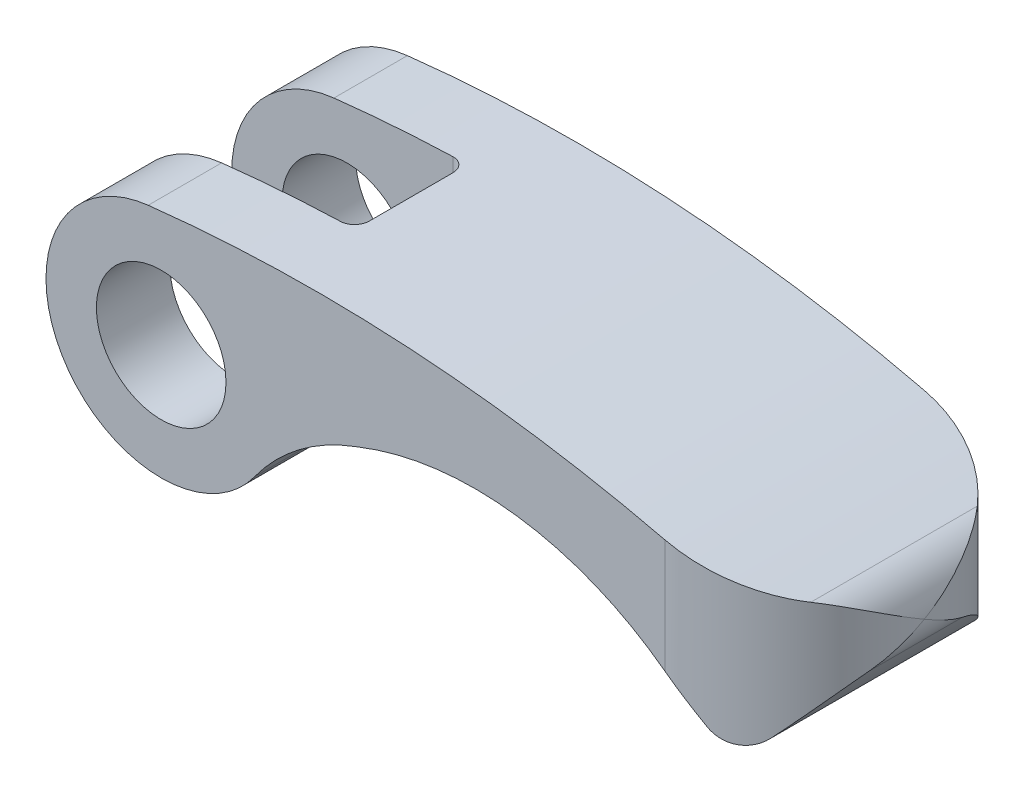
ISO-10303-21;
HEADER;
FILE_DESCRIPTION(('STEP AP214'),'2;1');
FILE_NAME('part.step','',(''),(''),'','','');
FILE_SCHEMA(('AUTOMOTIVE_DESIGN { 1 0 10303 214 1 1 1 1 }'));
ENDSEC;
DATA;
#1=APPLICATION_CONTEXT('core data for automotive mechanical design processes');
#2=APPLICATION_PROTOCOL_DEFINITION('international standard','automotive_design',2000,#1);
#3=PRODUCT_CONTEXT('',#1,'mechanical');
#4=PRODUCT('Part','Part','',(#3));
#5=PRODUCT_RELATED_PRODUCT_CATEGORY('part','',(#4));
#6=PRODUCT_DEFINITION_FORMATION('','',#4);
#7=PRODUCT_DEFINITION_CONTEXT('part definition',#1,'design');
#8=PRODUCT_DEFINITION('design','',#6,#7);
#9=PRODUCT_DEFINITION_SHAPE('','',#8);
#10=(LENGTH_UNIT() NAMED_UNIT(*) SI_UNIT(.MILLI.,.METRE.));
#11=(NAMED_UNIT(*) PLANE_ANGLE_UNIT() SI_UNIT($,.RADIAN.));
#12=(NAMED_UNIT(*) SI_UNIT($,.STERADIAN.) SOLID_ANGLE_UNIT());
#13=UNCERTAINTY_MEASURE_WITH_UNIT(LENGTH_MEASURE(1.E-05),#10,'distance_accuracy_value','');
#14=(GEOMETRIC_REPRESENTATION_CONTEXT(3) GLOBAL_UNCERTAINTY_ASSIGNED_CONTEXT((#13)) GLOBAL_UNIT_ASSIGNED_CONTEXT((#10,
#11,#12)) REPRESENTATION_CONTEXT('',''));
#15=CARTESIAN_POINT('',(0.,0.,0.));
#16=DIRECTION('',(0.,0.,1.));
#17=DIRECTION('',(1.,0.,0.));
#18=AXIS2_PLACEMENT_3D('',#15,#16,#17);
#19=CARTESIAN_POINT('',(0.,0.,9.));
#20=DIRECTION('',(0.,0.,-1.));
#21=DIRECTION('',(-1.,0.,0.));
#22=AXIS2_PLACEMENT_3D('',#19,#20,#21);
#23=CYLINDRICAL_SURFACE('',#22,8.);
#24=DIRECTION('',(0.,0.,-1.));
#25=VECTOR('',#24,1.);
#26=CARTESIAN_POINT('',(-0.90221048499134,7.94896321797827,9.));
#27=LINE('',#26,#25);
#28=CARTESIAN_POINT('',(-0.90221048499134,7.94896321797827,9.));
#29=VERTEX_POINT('',#28);
#30=CARTESIAN_POINT('',(-0.90221048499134,7.94896321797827,3.9));
#31=VERTEX_POINT('',#30);
#32=EDGE_CURVE('E155',#29,#31,#27,.T.);
#33=ORIENTED_EDGE('',*,*,#32,.T.);
#34=CARTESIAN_POINT('',(0.,0.,3.9));
#35=DIRECTION('',(0.,0.,1.));
#36=DIRECTION('',(1.,0.,0.));
#37=AXIS2_PLACEMENT_3D('',#34,#35,#36);
#38=CIRCLE('',#37,8.);
#39=CARTESIAN_POINT('',(6.48844630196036,-4.67975048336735,3.9));
#40=VERTEX_POINT('',#39);
#41=EDGE_CURVE('E250',#31,#40,#38,.T.);
#42=ORIENTED_EDGE('',*,*,#41,.T.);
#43=DIRECTION('',(0.,0.,-1.));
#44=VECTOR('',#43,1.);
#45=CARTESIAN_POINT('',(6.48844630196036,-4.67975048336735,9.));
#46=LINE('',#45,#44);
#47=CARTESIAN_POINT('',(6.48844630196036,-4.67975048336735,9.));
#48=VERTEX_POINT('',#47);
#49=EDGE_CURVE('E200',#48,#40,#46,.T.);
#50=ORIENTED_EDGE('',*,*,#49,.F.);
#51=CARTESIAN_POINT('',(0.,0.,9.));
#52=DIRECTION('',(0.,0.,1.));
#53=DIRECTION('',(1.,0.,0.));
#54=AXIS2_PLACEMENT_3D('',#51,#52,#53);
#55=CIRCLE('',#54,8.);
#56=EDGE_CURVE('E156',#29,#48,#55,.T.);
#57=ORIENTED_EDGE('',*,*,#56,.F.);
#58=EDGE_LOOP('',(#33,#42,#50,#57));
#59=FACE_BOUND('',#58,.T.);
#60=ADVANCED_FACE('F14',(#59),#23,.T.);
#61=CARTESIAN_POINT('',(41.,1.,9.));
#62=DIRECTION('',(0.,0.,-1.));
#63=DIRECTION('',(-1.,0.,0.));
#64=AXIS2_PLACEMENT_3D('',#61,#62,#63);
#65=CYLINDRICAL_SURFACE('',#64,3.);
#66=DIRECTION('',(0.,0.,-1.));
#67=VECTOR('',#66,1.);
#68=CARTESIAN_POINT('',(41.8962414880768,3.8629968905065,9.));
#69=LINE('',#68,#67);
#70=CARTESIAN_POINT('',(41.8962414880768,3.86299689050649,5.7828931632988));
#71=VERTEX_POINT('',#70);
#72=CARTESIAN_POINT('',(41.8962414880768,3.86299689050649,-5.7828931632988));
#73=VERTEX_POINT('',#72);
#74=EDGE_CURVE('E172',#71,#73,#69,.T.);
#75=ORIENTED_EDGE('',*,*,#74,.F.);
#76=CARTESIAN_POINT('',(41.8962414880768,3.86299689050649,5.7828931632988));
#77=CARTESIAN_POINT('',(41.9585607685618,3.84348410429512,5.70857649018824));
#78=CARTESIAN_POINT('',(42.0194338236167,3.82219864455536,5.63354317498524));
#79=CARTESIAN_POINT('',(42.1382624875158,3.77640355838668,5.48219499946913));
#80=CARTESIAN_POINT('',(42.1962189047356,3.75189483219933,5.40588050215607));
#81=CARTESIAN_POINT('',(42.3655158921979,3.6740941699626,5.17546673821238));
#82=CARTESIAN_POINT('',(42.4725165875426,3.61645262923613,5.01961913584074));
#83=CARTESIAN_POINT('',(42.6744475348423,3.49203218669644,4.70506484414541));
#84=CARTESIAN_POINT('',(42.7694334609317,3.42529864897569,4.54637554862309));
#85=CARTESIAN_POINT('',(42.948227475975,3.28415961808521,4.22603202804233));
#86=CARTESIAN_POINT('',(43.032028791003,3.20974952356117,4.06437607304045));
#87=CARTESIAN_POINT('',(43.2252706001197,3.01849618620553,3.66267678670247));
#88=CARTESIAN_POINT('',(43.3284019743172,2.89806801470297,3.42129086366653));
#89=CARTESIAN_POINT('',(43.5119649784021,2.64747112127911,2.9349691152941));
#90=CARTESIAN_POINT('',(43.5923887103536,2.51729903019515,2.69003208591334));
#91=CARTESIAN_POINT('',(43.7314028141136,2.2498735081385,2.19732378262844));
#92=CARTESIAN_POINT('',(43.7899568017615,2.11260870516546,1.94954848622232));
#93=CARTESIAN_POINT('',(43.8856163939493,1.83363611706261,1.45252620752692));
#94=CARTESIAN_POINT('',(43.9227320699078,1.69193045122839,1.20327997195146));
#95=CARTESIAN_POINT('',(43.9659639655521,1.45968964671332,0.797572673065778));
#96=CARTESIAN_POINT('',(43.9784847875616,1.36987899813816,0.64134363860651));
#97=CARTESIAN_POINT('',(43.9953480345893,1.18987221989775,0.328879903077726));
#98=CARTESIAN_POINT('',(43.9996998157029,1.09967664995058,0.172645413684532));
#99=CARTESIAN_POINT('',(43.9999949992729,1.00632454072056,0.0109544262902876));
#100=CARTESIAN_POINT('',(43.9999999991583,1.00316226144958,0.00547719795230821));
#101=CARTESIAN_POINT('',(44.,1.,0.));
#102=B_SPLINE_CURVE_WITH_KNOTS('',3,(#76,#77,#78,#79,#80,#81,#82,#83,#84,#85,#86,#87,#88,#89,
#90,#91,#92,#93,#94,#95,#96,#97,#98,#99,#100,#101),.UNSPECIFIED.,.F.,.F.,(4,2,2,2,2,2,2,2,2,2,2,
2,4),(0.,0.296726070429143,0.593369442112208,1.18554987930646,1.77487705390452,2.36455954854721,
3.22969626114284,4.09513350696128,4.9620042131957,5.82846734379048,6.37022582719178,
6.91136344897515,6.93033712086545),.UNSPECIFIED.);
#103=CARTESIAN_POINT('',(44.,1.,0.));
#104=VERTEX_POINT('',#103);
#105=EDGE_CURVE('E136',#71,#104,#102,.T.);
#106=ORIENTED_EDGE('',*,*,#105,.T.);
#107=CARTESIAN_POINT('',(41.8962414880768,3.86299689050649,-5.7828931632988));
#108=CARTESIAN_POINT('',(41.9585607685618,3.84348410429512,-5.70857649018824));
#109=CARTESIAN_POINT('',(42.0194338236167,3.82219864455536,-5.63354317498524));
#110=CARTESIAN_POINT('',(42.1382624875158,3.77640355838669,-5.48219499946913));
#111=CARTESIAN_POINT('',(42.1962189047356,3.75189483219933,-5.40588050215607));
#112=CARTESIAN_POINT('',(42.3655158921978,3.6740941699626,-5.17546673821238));
#113=CARTESIAN_POINT('',(42.4725165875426,3.61645262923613,-5.01961913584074));
#114=CARTESIAN_POINT('',(42.6744475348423,3.49203218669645,-4.70506484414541));
#115=CARTESIAN_POINT('',(42.7694334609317,3.42529864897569,-4.54637554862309));
#116=CARTESIAN_POINT('',(42.948227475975,3.28415961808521,-4.22603202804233));
#117=CARTESIAN_POINT('',(43.032028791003,3.20974952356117,-4.06437607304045));
#118=CARTESIAN_POINT('',(43.2252706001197,3.01849618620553,-3.66267678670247));
#119=CARTESIAN_POINT('',(43.3284019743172,2.89806801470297,-3.42129086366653));
#120=CARTESIAN_POINT('',(43.5119649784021,2.64747112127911,-2.9349691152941));
#121=CARTESIAN_POINT('',(43.5923887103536,2.51729903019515,-2.69003208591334));
#122=CARTESIAN_POINT('',(43.7314028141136,2.2498735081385,-2.19732378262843));
#123=CARTESIAN_POINT('',(43.7899568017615,2.11260870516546,-1.94954848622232));
#124=CARTESIAN_POINT('',(43.8856163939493,1.83363611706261,-1.45252620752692));
#125=CARTESIAN_POINT('',(43.9227320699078,1.69193045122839,-1.20327997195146));
#126=CARTESIAN_POINT('',(43.9659639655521,1.45968964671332,-0.797572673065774));
#127=CARTESIAN_POINT('',(43.9784847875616,1.36987899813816,-0.641343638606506));
#128=CARTESIAN_POINT('',(43.9953480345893,1.18987221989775,-0.328879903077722));
#129=CARTESIAN_POINT('',(43.9996998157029,1.09967664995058,-0.172645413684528));
#130=CARTESIAN_POINT('',(43.9999949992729,1.00632454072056,-0.0109544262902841));
#131=CARTESIAN_POINT('',(43.9999999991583,1.00316226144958,-0.00547719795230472));
#132=CARTESIAN_POINT('',(44.,1.,0.));
#133=B_SPLINE_CURVE_WITH_KNOTS('',3,(#107,#108,#109,#110,#111,#112,#113,#114,#115,#116,#117,
#118,#119,#120,#121,#122,#123,#124,#125,#126,#127,#128,#129,#130,#131,#132),.UNSPECIFIED.,.F.,
.F.,(4,2,2,2,2,2,2,2,2,2,2,2,4),(0.,0.296726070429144,0.59336944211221,1.18554987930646,
1.77487705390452,2.36455954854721,3.22969626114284,4.09513350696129,4.9620042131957,
5.82846734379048,6.37022582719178,6.91136344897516,6.93033712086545),.UNSPECIFIED.);
#134=EDGE_CURVE('E285',#104,#73,#133,.F.);
#135=ORIENTED_EDGE('',*,*,#134,.T.);
#136=EDGE_LOOP('',(#75,#106,#135));
#137=FACE_BOUND('',#136,.T.);
#138=ADVANCED_FACE('F309',(#137),#65,.T.);
#139=CARTESIAN_POINT('',(5.41326290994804,-47.6937793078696,9.));
#140=DIRECTION('',(0.,0.,1.));
#141=DIRECTION('',(1.,0.,0.));
#142=AXIS2_PLACEMENT_3D('',#139,#140,#141);
#143=PLANE('',#142);
#144=CARTESIAN_POINT('',(0.,0.,9.));
#145=DIRECTION('',(0.,0.,1.));
#146=DIRECTION('',(1.,0.,0.));
#147=AXIS2_PLACEMENT_3D('',#144,#145,#146);
#148=CIRCLE('',#147,4.5);
#149=CARTESIAN_POINT('',(4.5,0.,9.));
#150=VERTEX_POINT('',#149);
#151=EDGE_CURVE('E284',#150,#150,#148,.F.);
#152=ORIENTED_EDGE('',*,*,#151,.T.);
#153=EDGE_LOOP('',(#152));
#154=FACE_BOUND('',#153,.T.);
#155=CARTESIAN_POINT('',(21.8048695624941,-19.7429832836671,9.));
#156=DIRECTION('',(0.,0.,1.));
#157=DIRECTION('',(1.,0.,0.));
#158=AXIS2_PLACEMENT_3D('',#155,#156,#157);
#159=CIRCLE('',#158,22.);
#160=CARTESIAN_POINT('',(35.,-2.13933216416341,9.));
#161=VERTEX_POINT('',#160);
#162=CARTESIAN_POINT('',(13.6890217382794,0.705317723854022,9.));
#163=VERTEX_POINT('',#162);
#164=EDGE_CURVE('E148',#161,#163,#159,.T.);
#165=ORIENTED_EDGE('',*,*,#164,.F.);
#166=DIRECTION('',(0.,-1.,0.));
#167=VECTOR('',#166,1.);
#168=CARTESIAN_POINT('',(35.,11.,9.));
#169=LINE('',#168,#167);
#170=CARTESIAN_POINT('',(35.,5.7640263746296,9.));
#171=VERTEX_POINT('',#170);
#172=EDGE_CURVE('E133',#171,#161,#169,.T.);
#173=ORIENTED_EDGE('',*,*,#172,.F.);
#174=CARTESIAN_POINT('',(10.8265258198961,-95.3875586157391,9.));
#175=DIRECTION('',(0.,0.,1.));
#176=DIRECTION('',(1.,0.,0.));
#177=AXIS2_PLACEMENT_3D('',#174,#175,#176);
#178=CIRCLE('',#177,104.);
#179=EDGE_CURVE('E145',#171,#29,#178,.T.);
#180=ORIENTED_EDGE('',*,*,#179,.T.);
#181=ORIENTED_EDGE('',*,*,#56,.T.);
#182=CARTESIAN_POINT('',(18.6542829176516,-13.4542829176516,9.));
#183=DIRECTION('',(0.,0.,1.));
#184=DIRECTION('',(1.,0.,0.));
#185=AXIS2_PLACEMENT_3D('',#182,#183,#184);
#186=CIRCLE('',#185,15.);
#187=CARTESIAN_POINT('',(13.4617133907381,0.618286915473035,9.));
#188=VERTEX_POINT('',#187);
#189=EDGE_CURVE('E159',#188,#48,#186,.T.);
#190=ORIENTED_EDGE('',*,*,#189,.F.);
#191=CARTESIAN_POINT('',(10.000000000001,9.99999999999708,9.));
#192=DIRECTION('',(0.,0.,1.));
#193=DIRECTION('',(1.,0.,0.));
#194=AXIS2_PLACEMENT_3D('',#191,#192,#193);
#195=CIRCLE('',#194,9.99999999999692);
#196=EDGE_CURVE('E169',#188,#163,#195,.T.);
#197=ORIENTED_EDGE('',*,*,#196,.T.);
#198=EDGE_LOOP('',(#165,#173,#180,#181,#190,#197));
#199=FACE_BOUND('',#198,.T.);
#200=ADVANCED_FACE('F144',(#154,#199),#143,.T.);
#201=CARTESIAN_POINT('',(5.41326290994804,-47.6937793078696,-9.));
#202=DIRECTION('',(0.,0.,1.));
#203=DIRECTION('',(1.,0.,0.));
#204=AXIS2_PLACEMENT_3D('',#201,#202,#203);
#205=PLANE('',#204);
#206=CARTESIAN_POINT('',(0.,0.,-9.));
#207=DIRECTION('',(0.,0.,1.));
#208=DIRECTION('',(1.,0.,0.));
#209=AXIS2_PLACEMENT_3D('',#206,#207,#208);
#210=CIRCLE('',#209,4.5);
#211=CARTESIAN_POINT('',(4.5,0.,-9.));
#212=VERTEX_POINT('',#211);
#213=EDGE_CURVE('E434',#212,#212,#210,.F.);
#214=ORIENTED_EDGE('',*,*,#213,.F.);
#215=EDGE_LOOP('',(#214));
#216=FACE_BOUND('',#215,.T.);
#217=DIRECTION('',(0.,-1.,0.));
#218=VECTOR('',#217,1.);
#219=CARTESIAN_POINT('',(35.,11.,-9.));
#220=LINE('',#219,#218);
#221=CARTESIAN_POINT('',(35.,5.7640263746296,-9.));
#222=VERTEX_POINT('',#221);
#223=CARTESIAN_POINT('',(35.,-2.13933216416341,-9.));
#224=VERTEX_POINT('',#223);
#225=EDGE_CURVE('E149',#222,#224,#220,.T.);
#226=ORIENTED_EDGE('',*,*,#225,.T.);
#227=CARTESIAN_POINT('',(21.8048695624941,-19.7429832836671,-9.));
#228=DIRECTION('',(0.,0.,1.));
#229=DIRECTION('',(1.,0.,0.));
#230=AXIS2_PLACEMENT_3D('',#227,#228,#229);
#231=CIRCLE('',#230,22.);
#232=CARTESIAN_POINT('',(13.6890217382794,0.705317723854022,-9.));
#233=VERTEX_POINT('',#232);
#234=EDGE_CURVE('E157',#224,#233,#231,.T.);
#235=ORIENTED_EDGE('',*,*,#234,.T.);
#236=CARTESIAN_POINT('',(10.000000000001,9.99999999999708,-9.));
#237=DIRECTION('',(0.,0.,1.));
#238=DIRECTION('',(1.,0.,0.));
#239=AXIS2_PLACEMENT_3D('',#236,#237,#238);
#240=CIRCLE('',#239,9.99999999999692);
#241=CARTESIAN_POINT('',(13.4617133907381,0.618286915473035,-9.));
#242=VERTEX_POINT('',#241);
#243=EDGE_CURVE('E161',#242,#233,#240,.T.);
#244=ORIENTED_EDGE('',*,*,#243,.F.);
#245=CARTESIAN_POINT('',(18.6542829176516,-13.4542829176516,-9.));
#246=DIRECTION('',(0.,0.,1.));
#247=DIRECTION('',(1.,0.,0.));
#248=AXIS2_PLACEMENT_3D('',#245,#246,#247);
#249=CIRCLE('',#248,15.);
#250=CARTESIAN_POINT('',(6.48844630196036,-4.67975048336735,-9.));
#251=VERTEX_POINT('',#250);
#252=EDGE_CURVE('E179',#242,#251,#249,.T.);
#253=ORIENTED_EDGE('',*,*,#252,.T.);
#254=CARTESIAN_POINT('',(0.,0.,-9.));
#255=DIRECTION('',(0.,0.,1.));
#256=DIRECTION('',(1.,0.,0.));
#257=AXIS2_PLACEMENT_3D('',#254,#255,#256);
#258=CIRCLE('',#257,8.);
#259=CARTESIAN_POINT('',(-0.90221048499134,7.94896321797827,-9.));
#260=VERTEX_POINT('',#259);
#261=EDGE_CURVE('E176',#260,#251,#258,.T.);
#262=ORIENTED_EDGE('',*,*,#261,.F.);
#263=CARTESIAN_POINT('',(10.8265258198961,-95.3875586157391,-9.));
#264=DIRECTION('',(0.,0.,1.));
#265=DIRECTION('',(1.,0.,0.));
#266=AXIS2_PLACEMENT_3D('',#263,#264,#265);
#267=CIRCLE('',#266,104.);
#268=EDGE_CURVE('E173',#222,#260,#267,.T.);
#269=ORIENTED_EDGE('',*,*,#268,.F.);
#270=EDGE_LOOP('',(#226,#235,#244,#253,#262,#269));
#271=FACE_BOUND('',#270,.T.);
#272=ADVANCED_FACE('F310',(#216,#271),#205,.F.);
#273=CARTESIAN_POINT('',(10.8265258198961,-95.3875586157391,9.));
#274=DIRECTION('',(0.,0.,-1.));
#275=DIRECTION('',(-1.,0.,0.));
#276=AXIS2_PLACEMENT_3D('',#273,#274,#275);
#277=CYLINDRICAL_SURFACE('',#276,104.);
#278=ORIENTED_EDGE('',*,*,#74,.T.);
#279=CARTESIAN_POINT('',(41.8962414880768,3.86299689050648,-5.7828931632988));
#280=CARTESIAN_POINT('',(41.7289961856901,3.91535446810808,-5.98237249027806));
#281=CARTESIAN_POINT('',(41.553360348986,3.96986967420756,-6.17421276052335));
#282=CARTESIAN_POINT('',(41.1867976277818,4.08248966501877,-6.54146161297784));
#283=CARTESIAN_POINT('',(40.9958737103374,4.14059375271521,-6.71687336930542));
#284=CARTESIAN_POINT('',(40.6002454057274,4.25966063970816,-7.05011691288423));
#285=CARTESIAN_POINT('',(40.3955470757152,4.32062217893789,-7.207956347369));
#286=CARTESIAN_POINT('',(39.9737945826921,4.44472587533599,-7.50519265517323));
#287=CARTESIAN_POINT('',(39.7567402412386,4.50786806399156,-7.6445892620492));
#288=CARTESIAN_POINT('',(39.311842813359,4.63564003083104,-7.9040698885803));
#289=CARTESIAN_POINT('',(39.0840012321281,4.7002696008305,-8.02415659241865));
#290=CARTESIAN_POINT('',(38.6190688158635,4.83036804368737,-8.24430098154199));
#291=CARTESIAN_POINT('',(38.3819778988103,4.89583692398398,-8.34435848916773));
#292=CARTESIAN_POINT('',(37.900384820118,5.02692418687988,-8.52371545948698));
#293=CARTESIAN_POINT('',(37.6558899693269,5.09254236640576,-8.60303469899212));
#294=CARTESIAN_POINT('',(37.1610041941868,5.22337910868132,-8.74048082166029));
#295=CARTESIAN_POINT('',(36.9106151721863,5.28859779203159,-8.79861444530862));
#296=CARTESIAN_POINT('',(36.385086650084,5.42334930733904,-8.89711312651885));
#297=CARTESIAN_POINT('',(36.1095841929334,5.49280406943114,-8.93565918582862));
#298=CARTESIAN_POINT('',(35.5561474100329,5.62990394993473,-8.98710114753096));
#299=CARTESIAN_POINT('',(35.2782168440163,5.69755137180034,-9.00003140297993));
#300=CARTESIAN_POINT('',(35.,5.76402637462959,-9.));
#301=B_SPLINE_CURVE_WITH_KNOTS('',3,(#279,#280,#281,#282,#283,#284,#285,#286,#287,#288,#289,
#290,#291,#292,#293,#294,#295,#296,#297,#298,#299,#300),.UNSPECIFIED.,.F.,.F.,(4,2,2,2,2,2,2,2,
2,2,4),(0.,0.796289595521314,1.5924250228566,2.38821261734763,3.1840117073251,3.97970008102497,
4.77539551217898,5.57032934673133,6.36501004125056,7.22401104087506,8.08185926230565),.UNSPECIFIED.);
#302=EDGE_CURVE('E324',#73,#222,#301,.T.);
#303=ORIENTED_EDGE('',*,*,#302,.T.);
#304=ORIENTED_EDGE('',*,*,#268,.T.);
#305=CARTESIAN_POINT('',(-0.90221048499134,7.94896321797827,-3.9));
#306=VERTEX_POINT('',#305);
#307=EDGE_CURVE('E203',#306,#260,#27,.T.);
#308=ORIENTED_EDGE('',*,*,#307,.F.);
#309=CARTESIAN_POINT('',(10.8265258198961,-95.3875586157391,-3.9));
#310=DIRECTION('',(0.,0.,-1.));
#311=DIRECTION('',(-1.,0.,0.));
#312=AXIS2_PLACEMENT_3D('',#309,#310,#311);
#313=CIRCLE('',#312,104.);
#314=CARTESIAN_POINT('',(7.36,8.55465224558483,-3.9));
#315=VERTEX_POINT('',#314);
#316=EDGE_CURVE('E241',#306,#315,#313,.T.);
#317=ORIENTED_EDGE('',*,*,#316,.T.);
#318=CARTESIAN_POINT('',(8.36,8.58318847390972,-2.9));
#319=CARTESIAN_POINT('',(8.35999981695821,8.58318840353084,-2.92812827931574));
#320=CARTESIAN_POINT('',(8.35881245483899,8.58316030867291,-2.95624308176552));
#321=CARTESIAN_POINT('',(8.35407561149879,8.58304779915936,-3.01227147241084));
#322=CARTESIAN_POINT('',(8.35052624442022,8.58296338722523,-3.04018507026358));
#323=CARTESIAN_POINT('',(8.33636895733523,8.58262563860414,-3.12327500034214));
#324=CARTESIAN_POINT('',(8.32225175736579,8.58228779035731,-3.17789471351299));
#325=CARTESIAN_POINT('',(8.28505141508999,8.58138506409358,-3.28398649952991));
#326=CARTESIAN_POINT('',(8.26196398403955,8.58082007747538,-3.33545705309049));
#327=CARTESIAN_POINT('',(8.20748199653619,8.57946187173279,-3.43378943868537));
#328=CARTESIAN_POINT('',(8.17608889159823,8.57866869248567,-3.48065207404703));
#329=CARTESIAN_POINT('',(8.1058843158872,8.57685519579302,-3.56844347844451));
#330=CARTESIAN_POINT('',(8.06707224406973,8.57583485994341,-3.60937176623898));
#331=CARTESIAN_POINT('',(7.98312413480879,8.57357270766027,-3.68414006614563));
#332=CARTESIAN_POINT('',(7.9379868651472,8.57233084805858,-3.71797869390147));
#333=CARTESIAN_POINT('',(7.84266104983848,8.5696384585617,-3.77761146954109));
#334=CARTESIAN_POINT('',(7.79247017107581,8.56818783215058,-3.80340187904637));
#335=CARTESIAN_POINT('',(7.68848620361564,8.56510082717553,-3.84617791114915));
#336=CARTESIAN_POINT('',(7.63469521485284,8.56346455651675,-3.86316861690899));
#337=CARTESIAN_POINT('',(7.54381457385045,8.56062613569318,-3.88365802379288));
#338=CARTESIAN_POINT('',(7.50729394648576,8.55946653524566,-3.88978268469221));
#339=CARTESIAN_POINT('',(7.43385372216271,8.55709558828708,-3.89795313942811));
#340=CARTESIAN_POINT('',(7.39693476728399,8.55588431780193,-3.90000472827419));
#341=CARTESIAN_POINT('',(7.36,8.55465224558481,-3.9));
#342=B_SPLINE_CURVE_WITH_KNOTS('',3,(#318,#319,#320,#321,#322,#323,#324,#325,#326,#327,#328,
#329,#330,#331,#332,#333,#334,#335,#336,#337,#338,#339,#340,#341),.UNSPECIFIED.,.F.,.F.,(4,2,2,
2,2,2,2,2,2,2,2,4),(0.,0.0843330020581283,0.168661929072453,0.337040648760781,0.505499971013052,
0.673929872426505,0.84237342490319,1.01084983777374,1.17940439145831,1.34786147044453,
1.45879629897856,1.56957318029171),.UNSPECIFIED.);
#343=CARTESIAN_POINT('',(8.36,8.58318847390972,-2.9));
#344=VERTEX_POINT('',#343);
#345=EDGE_CURVE('E233',#344,#315,#342,.T.);
#346=ORIENTED_EDGE('',*,*,#345,.F.);
#347=DIRECTION('',(0.,0.,-1.));
#348=VECTOR('',#347,1.);
#349=CARTESIAN_POINT('',(8.36,8.58318847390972,9.));
#350=LINE('',#349,#348);
#351=CARTESIAN_POINT('',(8.36,8.58318847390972,2.9));
#352=VERTEX_POINT('',#351);
#353=EDGE_CURVE('E240',#344,#352,#350,.F.);
#354=ORIENTED_EDGE('',*,*,#353,.T.);
#355=CARTESIAN_POINT('',(7.36,8.55465224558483,3.9));
#356=CARTESIAN_POINT('',(7.38813959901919,8.55559077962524,3.8999998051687));
#357=CARTESIAN_POINT('',(7.41626612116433,8.55651729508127,3.8988114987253));
#358=CARTESIAN_POINT('',(7.4723188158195,8.55834115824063,3.89407061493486));
#359=CARTESIAN_POINT('',(7.50024499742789,8.55923850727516,3.89051814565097));
#360=CARTESIAN_POINT('',(7.58337512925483,8.56187636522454,3.87634768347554));
#361=CARTESIAN_POINT('',(7.63802359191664,8.56356577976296,3.86221654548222));
#362=CARTESIAN_POINT('',(7.7441748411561,8.56676761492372,3.82497534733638));
#363=CARTESIAN_POINT('',(7.79567606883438,8.56827994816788,3.80186087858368));
#364=CARTESIAN_POINT('',(7.89406708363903,8.57110195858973,3.7473098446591));
#365=CARTESIAN_POINT('',(7.94095771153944,8.57241167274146,3.7158748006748));
#366=CARTESIAN_POINT('',(8.02877938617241,8.57481221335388,3.64558515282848));
#367=CARTESIAN_POINT('',(8.06971245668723,8.57590311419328,3.60673307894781));
#368=CARTESIAN_POINT('',(8.14448397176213,8.57785897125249,3.52269425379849));
#369=CARTESIAN_POINT('',(8.17832102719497,8.57872388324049,3.47750626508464));
#370=CARTESIAN_POINT('',(8.2379198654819,8.58022490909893,3.38210065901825));
#371=CARTESIAN_POINT('',(8.26368316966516,8.58086106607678,3.33188399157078));
#372=CARTESIAN_POINT('',(8.3064006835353,8.58190530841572,3.22784605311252));
#373=CARTESIAN_POINT('',(8.32336009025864,8.58231352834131,3.17402692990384));
#374=CARTESIAN_POINT('',(8.34376242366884,8.58280230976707,3.08323064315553));
#375=CARTESIAN_POINT('',(8.34984784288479,8.58294727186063,3.04682566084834));
#376=CARTESIAN_POINT('',(8.35796608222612,8.58314022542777,2.97361888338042));
#377=CARTESIAN_POINT('',(8.36000465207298,8.58318835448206,2.93681772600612));
#378=CARTESIAN_POINT('',(8.36,8.58318847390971,2.9));
#379=B_SPLINE_CURVE_WITH_KNOTS('',3,(#355,#356,#357,#358,#359,#360,#361,#362,#363,#364,#365,
#366,#367,#368,#369,#370,#371,#372,#373,#374,#375,#376,#377,#378),.UNSPECIFIED.,.F.,.F.,(4,2,2,
2,2,2,2,2,2,2,2,4),(0.,0.0844138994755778,0.168823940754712,0.337368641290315,0.505996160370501,
0.67459287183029,0.843132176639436,1.01170444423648,1.18024492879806,1.34868580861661,
1.45920743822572,1.56957192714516),.UNSPECIFIED.);
#380=CARTESIAN_POINT('',(7.36,8.55465224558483,3.9));
#381=VERTEX_POINT('',#380);
#382=EDGE_CURVE('E245',#381,#352,#379,.T.);
#383=ORIENTED_EDGE('',*,*,#382,.F.);
#384=CARTESIAN_POINT('',(10.8265258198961,-95.3875586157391,3.9));
#385=DIRECTION('',(0.,0.,1.));
#386=DIRECTION('',(1.,0.,0.));
#387=AXIS2_PLACEMENT_3D('',#384,#385,#386);
#388=CIRCLE('',#387,104.);
#389=EDGE_CURVE('E164',#381,#31,#388,.T.);
#390=ORIENTED_EDGE('',*,*,#389,.T.);
#391=ORIENTED_EDGE('',*,*,#32,.F.);
#392=ORIENTED_EDGE('',*,*,#179,.F.);
#393=CARTESIAN_POINT('',(35.,5.7640263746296,9.));
#394=CARTESIAN_POINT('',(35.2612335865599,5.70160677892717,9.00002299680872));
#395=CARTESIAN_POINT('',(35.5222074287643,5.6381584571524,8.98862738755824));
#396=CARTESIAN_POINT('',(36.0417910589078,5.50972296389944,8.94329690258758));
#397=CARTESIAN_POINT('',(36.3004010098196,5.44473589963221,8.90936359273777));
#398=CARTESIAN_POINT('',(36.813632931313,5.31368576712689,8.81922328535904));
#399=CARTESIAN_POINT('',(37.068251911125,5.24762196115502,8.76300034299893));
#400=CARTESIAN_POINT('',(37.5715405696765,5.11503770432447,8.62873119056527));
#401=CARTESIAN_POINT('',(37.8202103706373,5.04851726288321,8.55068542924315));
#402=CARTESIAN_POINT('',(38.3100052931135,4.91559585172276,8.37327557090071));
#403=CARTESIAN_POINT('',(38.5511266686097,4.84919495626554,8.27390107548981));
#404=CARTESIAN_POINT('',(39.0240186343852,4.71719484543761,8.05451506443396));
#405=CARTESIAN_POINT('',(39.2557892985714,4.65159562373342,7.93450371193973));
#406=CARTESIAN_POINT('',(39.7080024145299,4.52197824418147,7.67480243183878));
#407=CARTESIAN_POINT('',(39.9284614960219,4.4579578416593,7.53514259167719));
#408=CARTESIAN_POINT('',(40.3567567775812,4.33212488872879,7.23693529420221));
#409=CARTESIAN_POINT('',(40.5645976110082,4.27031153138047,7.07839483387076));
#410=CARTESIAN_POINT('',(40.9695743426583,4.14857576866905,6.74053766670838));
#411=CARTESIAN_POINT('',(41.1664709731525,4.08870274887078,6.56091599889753));
#412=CARTESIAN_POINT('',(41.5439316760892,3.97279608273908,6.18450138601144));
#413=CARTESIAN_POINT('',(41.7245113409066,3.91675878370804,5.98772519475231));
#414=CARTESIAN_POINT('',(41.8962414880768,3.86299689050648,5.7828931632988));
#415=B_SPLINE_CURVE_WITH_KNOTS('',3,(#393,#394,#395,#396,#397,#398,#399,#400,#401,#402,#403,
#404,#405,#406,#407,#408,#409,#410,#411,#412,#413,#414),.UNSPECIFIED.,.F.,.F.,(4,2,2,2,2,2,2,2,
2,2,4),(0.,0.805499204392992,1.6109424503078,2.41696291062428,3.22296679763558,4.02936453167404,
4.83575589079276,5.64092560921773,6.44579786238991,7.26422670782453,8.08186500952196),.UNSPECIFIED.);
#416=EDGE_CURVE('E130',#171,#71,#415,.T.);
#417=ORIENTED_EDGE('',*,*,#416,.T.);
#418=EDGE_LOOP('',(#278,#303,#304,#308,#317,#346,#354,#383,#390,#391,#392,#417));
#419=FACE_BOUND('',#418,.T.);
#420=ADVANCED_FACE('F16',(#419),#277,.T.);
#421=CARTESIAN_POINT('',(6.48844630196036,-4.67975048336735,-3.9));
#422=VERTEX_POINT('',#421);
#423=EDGE_CURVE('E199',#422,#251,#46,.T.);
#424=ORIENTED_EDGE('',*,*,#423,.F.);
#425=CARTESIAN_POINT('',(0.,0.,-3.9));
#426=DIRECTION('',(0.,0.,-1.));
#427=DIRECTION('',(-1.,0.,0.));
#428=AXIS2_PLACEMENT_3D('',#425,#426,#427);
#429=CIRCLE('',#428,8.);
#430=EDGE_CURVE('E31',#422,#306,#429,.T.);
#431=ORIENTED_EDGE('',*,*,#430,.T.);
#432=ORIENTED_EDGE('',*,*,#307,.T.);
#433=ORIENTED_EDGE('',*,*,#261,.T.);
#434=EDGE_LOOP('',(#424,#431,#432,#433));
#435=FACE_BOUND('',#434,.T.);
#436=ADVANCED_FACE('F390',(#435),#23,.T.);
#437=CARTESIAN_POINT('',(18.6542829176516,-13.4542829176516,9.));
#438=DIRECTION('',(0.,0.,-1.));
#439=DIRECTION('',(-1.,0.,0.));
#440=AXIS2_PLACEMENT_3D('',#437,#438,#439);
#441=CYLINDRICAL_SURFACE('',#440,15.);
#442=CARTESIAN_POINT('',(18.6542829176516,-13.4542829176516,3.9));
#443=DIRECTION('',(0.,0.,1.));
#444=DIRECTION('',(1.,0.,0.));
#445=AXIS2_PLACEMENT_3D('',#442,#443,#444);
#446=CIRCLE('',#445,15.);
#447=CARTESIAN_POINT('',(7.36,-3.58315464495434,3.9));
#448=VERTEX_POINT('',#447);
#449=EDGE_CURVE('E9',#448,#40,#446,.T.);
#450=ORIENTED_EDGE('',*,*,#449,.F.);
#451=CARTESIAN_POINT('',(7.36,-3.58315464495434,3.9));
#452=CARTESIAN_POINT('',(7.39851630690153,-3.53908012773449,3.89998651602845));
#453=CARTESIAN_POINT('',(7.43731150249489,-3.49521738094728,3.89777298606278));
#454=CARTESIAN_POINT('',(7.5152621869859,-3.40810876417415,3.88865836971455));
#455=CARTESIAN_POINT('',(7.55441834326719,-3.36486475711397,3.88174531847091));
#456=CARTESIAN_POINT('',(7.63316006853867,-3.27890608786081,3.86282934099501));
#457=CARTESIAN_POINT('',(7.67274519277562,-3.2362038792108,3.85076672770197));
#458=CARTESIAN_POINT('',(7.75139649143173,-3.15232346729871,3.82117998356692));
#459=CARTESIAN_POINT('',(7.79046322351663,-3.111143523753,3.80366231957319));
#460=CARTESIAN_POINT('',(7.87554210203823,-3.02244448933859,3.75848294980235));
#461=CARTESIAN_POINT('',(7.92132207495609,-2.9753729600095,3.7294733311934));
#462=CARTESIAN_POINT('',(8.00982251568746,-2.88548846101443,3.66210728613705));
#463=CARTESIAN_POINT('',(8.05255401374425,-2.84265989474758,3.62378702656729));
#464=CARTESIAN_POINT('',(8.12446143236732,-2.77135925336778,3.54634629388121));
#465=CARTESIAN_POINT('',(8.15458427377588,-2.74177378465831,3.50914118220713));
#466=CARTESIAN_POINT('',(8.21040764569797,-2.68734346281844,3.42840072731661));
#467=CARTESIAN_POINT('',(8.23611143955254,-2.66249510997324,3.38487009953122));
#468=CARTESIAN_POINT('',(8.27712092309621,-2.62307049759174,3.30080137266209));
#469=CARTESIAN_POINT('',(8.29347461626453,-2.60743920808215,3.26127207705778));
#470=CARTESIAN_POINT('',(8.32125576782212,-2.58097067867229,3.17903785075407));
#471=CARTESIAN_POINT('',(8.33269285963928,-2.57012406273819,3.13633932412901));
#472=CARTESIAN_POINT('',(8.34742594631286,-2.55617417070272,3.06127194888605));
#473=CARTESIAN_POINT('',(8.35211161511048,-2.55174656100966,3.02941397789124));
#474=CARTESIAN_POINT('',(8.35841205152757,-2.54579777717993,2.96504832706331));
#475=CARTESIAN_POINT('',(8.36001896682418,-2.54428403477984,2.93253919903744));
#476=CARTESIAN_POINT('',(8.36,-2.54429945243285,2.9));
#477=B_SPLINE_CURVE_WITH_KNOTS('',3,(#451,#452,#453,#454,#455,#456,#457,#458,#459,#460,#461,
#462,#463,#464,#465,#466,#467,#468,#469,#470,#471,#472,#473,#474,#475,#476),.UNSPECIFIED.,.F.,
.F.,(4,2,2,2,2,2,2,2,2,2,2,2,4),(0.,0.175591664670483,0.351632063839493,0.529770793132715,
0.707699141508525,0.922379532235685,1.13623897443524,1.3044669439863,1.47257014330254,
1.60866028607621,1.74448254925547,1.84172530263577,1.93921574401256),.UNSPECIFIED.);
#478=CARTESIAN_POINT('',(8.36,-2.54429945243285,2.9));
#479=VERTEX_POINT('',#478);
#480=EDGE_CURVE('E24',#448,#479,#477,.T.);
#481=ORIENTED_EDGE('',*,*,#480,.T.);
#482=DIRECTION('',(0.,0.,-1.));
#483=VECTOR('',#482,1.);
#484=CARTESIAN_POINT('',(8.36,-2.54429945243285,9.));
#485=LINE('',#484,#483);
#486=CARTESIAN_POINT('',(8.36,-2.54429945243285,-2.9));
#487=VERTEX_POINT('',#486);
#488=EDGE_CURVE('E216',#487,#479,#485,.F.);
#489=ORIENTED_EDGE('',*,*,#488,.F.);
#490=CARTESIAN_POINT('',(8.36,-2.54429945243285,-2.9));
#491=CARTESIAN_POINT('',(8.36000273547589,-2.54429737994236,-2.92262462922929));
#492=CARTESIAN_POINT('',(8.35923150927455,-2.54502452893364,-2.94523592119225));
#493=CARTESIAN_POINT('',(8.35617412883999,-2.54791037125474,-2.99024965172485));
#494=CARTESIAN_POINT('',(8.35388894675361,-2.55006814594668,-3.01265221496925));
#495=CARTESIAN_POINT('',(8.34486088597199,-2.55860080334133,-3.078946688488));
#496=CARTESIAN_POINT('',(8.33594424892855,-2.56703606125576,-3.12230825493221));
#497=CARTESIAN_POINT('',(8.31297097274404,-2.58885553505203,-3.20616695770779));
#498=CARTESIAN_POINT('',(8.29892560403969,-2.60222890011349,-3.24667014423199));
#499=CARTESIAN_POINT('',(8.2665305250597,-2.63323379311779,-3.3242330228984));
#500=CARTESIAN_POINT('',(8.24817248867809,-2.65087355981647,-3.36128585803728));
#501=CARTESIAN_POINT('',(8.20079994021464,-2.69667518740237,-3.4441326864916));
#502=CARTESIAN_POINT('',(8.17032952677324,-2.72633784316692,-3.48826286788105));
#503=CARTESIAN_POINT('',(8.10502484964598,-2.79054699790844,-3.56906477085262));
#504=CARTESIAN_POINT('',(8.07018421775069,-2.82510063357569,-3.60572539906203));
#505=CARTESIAN_POINT('',(7.983732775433,-2.91177956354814,-3.68458332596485));
#506=CARTESIAN_POINT('',(7.93081385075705,-2.9655624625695,-3.72351408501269));
#507=CARTESIAN_POINT('',(7.82219160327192,-3.07777351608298,-3.78905702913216));
#508=CARTESIAN_POINT('',(7.76647971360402,-3.13621633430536,-3.81562837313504));
#509=CARTESIAN_POINT('',(7.65178966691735,-3.25857529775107,-3.85851830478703));
#510=CARTESIAN_POINT('',(7.5927719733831,-3.3226179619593,-3.8743650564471));
#511=CARTESIAN_POINT('',(7.50478832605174,-3.4198088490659,-3.88990516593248));
#512=CARTESIAN_POINT('',(7.47568059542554,-3.45224530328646,-3.89371458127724));
#513=CARTESIAN_POINT('',(7.41766912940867,-3.51746182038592,-3.89875872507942));
#514=CARTESIAN_POINT('',(7.38876527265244,-3.55024164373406,-3.89999514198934));
#515=CARTESIAN_POINT('',(7.36,-3.58315464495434,-3.9));
#516=B_SPLINE_CURVE_WITH_KNOTS('',3,(#490,#491,#492,#493,#494,#495,#496,#497,#498,#499,#500,
#501,#502,#503,#504,#505,#506,#507,#508,#509,#510,#511,#512,#513,#514,#515),.UNSPECIFIED.,.F.,
.F.,(4,2,2,2,2,2,2,2,2,2,2,2,4),(0.,0.0678236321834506,0.135603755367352,0.270032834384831,
0.404168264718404,0.538564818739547,0.721408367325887,0.904521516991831,1.15784308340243,
1.41199589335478,1.6767079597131,1.80788959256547,1.93898511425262),.UNSPECIFIED.);
#517=CARTESIAN_POINT('',(7.36,-3.58315464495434,-3.9));
#518=VERTEX_POINT('',#517);
#519=EDGE_CURVE('E207',#487,#518,#516,.T.);
#520=ORIENTED_EDGE('',*,*,#519,.T.);
#521=CARTESIAN_POINT('',(18.6542829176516,-13.4542829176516,-3.9));
#522=DIRECTION('',(0.,0.,-1.));
#523=DIRECTION('',(-1.,0.,0.));
#524=AXIS2_PLACEMENT_3D('',#521,#522,#523);
#525=CIRCLE('',#524,15.);
#526=EDGE_CURVE('E205',#422,#518,#525,.T.);
#527=ORIENTED_EDGE('',*,*,#526,.F.);
#528=ORIENTED_EDGE('',*,*,#423,.T.);
#529=ORIENTED_EDGE('',*,*,#252,.F.);
#530=DIRECTION('',(0.,0.,-1.));
#531=VECTOR('',#530,1.);
#532=CARTESIAN_POINT('',(13.4617133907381,0.618286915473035,9.));
#533=LINE('',#532,#531);
#534=EDGE_CURVE('E197',#188,#242,#533,.T.);
#535=ORIENTED_EDGE('',*,*,#534,.F.);
#536=ORIENTED_EDGE('',*,*,#189,.T.);
#537=ORIENTED_EDGE('',*,*,#49,.T.);
#538=EDGE_LOOP('',(#450,#481,#489,#520,#527,#528,#529,#535,#536,#537));
#539=FACE_BOUND('',#538,.T.);
#540=ADVANCED_FACE('F218',(#539),#441,.F.);
#541=CARTESIAN_POINT('',(10.000000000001,9.99999999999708,9.));
#542=DIRECTION('',(0.,0.,-1.));
#543=DIRECTION('',(-1.,0.,0.));
#544=AXIS2_PLACEMENT_3D('',#541,#542,#543);
#545=CYLINDRICAL_SURFACE('',#544,9.99999999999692);
#546=ORIENTED_EDGE('',*,*,#243,.T.);
#547=DIRECTION('',(0.,0.,-1.));
#548=VECTOR('',#547,1.);
#549=CARTESIAN_POINT('',(13.6890217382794,0.705317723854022,9.));
#550=LINE('',#549,#548);
#551=EDGE_CURVE('E194',#163,#233,#550,.T.);
#552=ORIENTED_EDGE('',*,*,#551,.F.);
#553=ORIENTED_EDGE('',*,*,#196,.F.);
#554=ORIENTED_EDGE('',*,*,#534,.T.);
#555=EDGE_LOOP('',(#546,#552,#553,#554));
#556=FACE_BOUND('',#555,.T.);
#557=ADVANCED_FACE('F402',(#556),#545,.T.);
#558=CARTESIAN_POINT('',(21.8048695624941,-19.7429832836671,9.));
#559=DIRECTION('',(0.,0.,-1.));
#560=DIRECTION('',(-1.,0.,0.));
#561=AXIS2_PLACEMENT_3D('',#558,#559,#560);
#562=CYLINDRICAL_SURFACE('',#561,22.);
#563=CARTESIAN_POINT('',(37.5670724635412,-4.39524860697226,-8.62613117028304));
#564=CARTESIAN_POINT('',(37.370496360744,-4.19334607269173,-8.68462264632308));
#565=CARTESIAN_POINT('',(37.1691243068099,-3.9943156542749,-8.73724092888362));
#566=CARTESIAN_POINT('',(36.7581028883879,-3.60356662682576,-8.8291157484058));
#567=CARTESIAN_POINT('',(36.5484907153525,-3.41182145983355,-8.86842601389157));
#568=CARTESIAN_POINT('',(36.1206606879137,-3.03552289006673,-8.93257482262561));
#569=CARTESIAN_POINT('',(35.9024416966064,-2.85097044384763,-8.95741144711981));
#570=CARTESIAN_POINT('',(35.4573345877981,-2.48919929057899,-8.99115421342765));
#571=CARTESIAN_POINT('',(35.2304145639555,-2.31201379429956,-8.99999454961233));
#572=CARTESIAN_POINT('',(35.,-2.13933216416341,-9.));
#573=B_SPLINE_CURVE_WITH_KNOTS('',3,(#563,#564,#565,#566,#567,#568,#569,#570,#571,#572),
.UNSPECIFIED.,.F.,.F.,(4,2,2,2,4),(0.,0.863379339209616,1.72323018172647,2.58319498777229,
3.44668954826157),.UNSPECIFIED.);
#574=CARTESIAN_POINT('',(37.5670724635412,-4.39524860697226,-8.62613117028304));
#575=VERTEX_POINT('',#574);
#576=EDGE_CURVE('E39',#575,#224,#573,.T.);
#577=ORIENTED_EDGE('',*,*,#576,.F.);
#578=DIRECTION('',(0.,0.,-1.));
#579=VECTOR('',#578,1.);
#580=CARTESIAN_POINT('',(37.5670724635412,-4.39524860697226,9.));
#581=LINE('',#580,#579);
#582=CARTESIAN_POINT('',(37.5670724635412,-4.39524860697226,8.62613117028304));
#583=VERTEX_POINT('',#582);
#584=EDGE_CURVE('E191',#583,#575,#581,.T.);
#585=ORIENTED_EDGE('',*,*,#584,.F.);
#586=CARTESIAN_POINT('',(35.,-2.13933216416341,9.));
#587=CARTESIAN_POINT('',(35.2304145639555,-2.31201379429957,8.99999454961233));
#588=CARTESIAN_POINT('',(35.4573345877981,-2.489199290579,8.99115421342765));
#589=CARTESIAN_POINT('',(35.9024416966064,-2.85097044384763,8.95741144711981));
#590=CARTESIAN_POINT('',(36.1206606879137,-3.03552289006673,8.93257482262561));
#591=CARTESIAN_POINT('',(36.5484907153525,-3.41182145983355,8.86842601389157));
#592=CARTESIAN_POINT('',(36.7581028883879,-3.60356662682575,8.82911574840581));
#593=CARTESIAN_POINT('',(37.1691243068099,-3.99431565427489,8.73724092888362));
#594=CARTESIAN_POINT('',(37.370496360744,-4.19334607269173,8.68462264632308));
#595=CARTESIAN_POINT('',(37.5670724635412,-4.39524860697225,8.62613117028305));
#596=B_SPLINE_CURVE_WITH_KNOTS('',3,(#586,#587,#588,#589,#590,#591,#592,#593,#594,#595),
.UNSPECIFIED.,.F.,.F.,(4,2,2,2,4),(0.,0.863494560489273,1.72345936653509,2.58331020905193,
3.44668954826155),.UNSPECIFIED.);
#597=EDGE_CURVE('E369',#161,#583,#596,.T.);
#598=ORIENTED_EDGE('',*,*,#597,.F.);
#599=ORIENTED_EDGE('',*,*,#164,.T.);
#600=ORIENTED_EDGE('',*,*,#551,.T.);
#601=ORIENTED_EDGE('',*,*,#234,.F.);
#602=EDGE_LOOP('',(#577,#585,#598,#599,#600,#601));
#603=FACE_BOUND('',#602,.T.);
#604=ADVANCED_FACE('F358',(#603),#562,.F.);
#605=CARTESIAN_POINT('',(39.,-3.,9.));
#606=DIRECTION('',(0.,0.,-1.));
#607=DIRECTION('',(-1.,0.,0.));
#608=AXIS2_PLACEMENT_3D('',#605,#606,#607);
#609=CYLINDRICAL_SURFACE('',#608,2.);
#610=ORIENTED_EDGE('',*,*,#584,.T.);
#611=CARTESIAN_POINT('',(37.5670724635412,-4.39524860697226,-8.62613117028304));
#612=CARTESIAN_POINT('',(37.6067056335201,-4.4359640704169,-8.61433875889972));
#613=CARTESIAN_POINT('',(37.6479662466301,-4.47485649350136,-8.60176057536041));
#614=CARTESIAN_POINT('',(37.7333172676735,-4.54877112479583,-8.5750199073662));
#615=CARTESIAN_POINT('',(37.7774067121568,-4.58379463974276,-8.56085796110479));
#616=CARTESIAN_POINT('',(37.867848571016,-4.64965202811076,-8.53098491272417));
#617=CARTESIAN_POINT('',(37.9141919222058,-4.6805010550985,-8.5152797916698));
#618=CARTESIAN_POINT('',(38.0088549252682,-4.7380169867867,-8.48229403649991));
#619=CARTESIAN_POINT('',(38.0571746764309,-4.76468368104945,-8.46501332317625));
#620=CARTESIAN_POINT('',(38.2043781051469,-4.83819984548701,-8.41087544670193));
#621=CARTESIAN_POINT('',(38.3056667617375,-4.87868119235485,-8.37167026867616));
#622=CARTESIAN_POINT('',(38.5112215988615,-4.94234574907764,-8.2875624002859));
#623=CARTESIAN_POINT('',(38.6154895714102,-4.96551831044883,-8.24265622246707));
#624=CARTESIAN_POINT('',(38.8299930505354,-4.99586332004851,-8.14529140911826));
#625=CARTESIAN_POINT('',(38.9402365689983,-5.00206975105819,-8.09255102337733));
#626=CARTESIAN_POINT('',(39.1581354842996,-4.99672043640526,-7.98278319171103));
#627=CARTESIAN_POINT('',(39.2657891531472,-4.98515314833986,-7.9257529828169));
#628=CARTESIAN_POINT('',(39.4879739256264,-4.94320295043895,-7.80230494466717));
#629=CARTESIAN_POINT('',(39.6019493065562,-4.91088099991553,-7.73554636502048));
#630=CARTESIAN_POINT('',(39.8216706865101,-4.82720756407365,-7.60053482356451));
#631=CARTESIAN_POINT('',(39.9274178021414,-4.77585866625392,-7.53228206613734));
#632=CARTESIAN_POINT('',(40.1119431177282,-4.66527377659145,-7.4079869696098));
#633=CARTESIAN_POINT('',(40.192277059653,-4.60878365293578,-7.35180757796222));
#634=CARTESIAN_POINT('',(40.3065379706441,-4.51505253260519,-7.26930996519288));
#635=CARTESIAN_POINT('',(40.3435773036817,-4.48231788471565,-7.24211193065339));
#636=CARTESIAN_POINT('',(40.4154426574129,-4.41385352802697,-7.18853218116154));
#637=CARTESIAN_POINT('',(40.4502678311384,-4.37812268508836,-7.16215078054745));
#638=CARTESIAN_POINT('',(40.4839013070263,-4.34090898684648,-7.13630341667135));
#639=B_SPLINE_CURVE_WITH_KNOTS('',3,(#611,#612,#613,#614,#615,#616,#617,#618,#619,#620,#621,
#622,#623,#624,#625,#626,#627,#628,#629,#630,#631,#632,#633,#634,#635,#636,#637,#638),
.UNSPECIFIED.,.F.,.F.,(4,2,2,2,2,2,2,2,2,2,2,2,2,4),(0.,0.17402474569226,0.347990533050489,
0.521306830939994,0.694631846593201,1.04067474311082,1.38693035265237,1.75252676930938,
2.1183607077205,2.52464526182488,2.93087458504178,3.2693179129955,3.43846343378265,
3.60767327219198),.UNSPECIFIED.);
#640=CARTESIAN_POINT('',(40.4839013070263,-4.34090898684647,-7.13630341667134));
#641=VERTEX_POINT('',#640);
#642=EDGE_CURVE('E343',#575,#641,#639,.T.);
#643=ORIENTED_EDGE('',*,*,#642,.T.);
#644=DIRECTION('',(0.,0.,-1.));
#645=VECTOR('',#644,1.);
#646=CARTESIAN_POINT('',(40.4839013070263,-4.34090898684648,9.));
#647=LINE('',#646,#645);
#648=CARTESIAN_POINT('',(40.4839013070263,-4.34090898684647,7.13630341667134));
#649=VERTEX_POINT('',#648);
#650=EDGE_CURVE('E188',#649,#641,#647,.T.);
#651=ORIENTED_EDGE('',*,*,#650,.F.);
#652=CARTESIAN_POINT('',(40.4839013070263,-4.34090898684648,7.13630341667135));
#653=CARTESIAN_POINT('',(40.432868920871,-4.39735686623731,7.17553257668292));
#654=CARTESIAN_POINT('',(40.3790944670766,-4.45041475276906,7.2159724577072));
#655=CARTESIAN_POINT('',(40.266637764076,-4.54960207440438,7.29844745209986));
#656=CARTESIAN_POINT('',(40.2079571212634,-4.59573376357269,7.34048204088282));
#657=CARTESIAN_POINT('',(40.0861916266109,-4.68098433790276,7.42537389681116));
#658=CARTESIAN_POINT('',(40.0231039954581,-4.72009874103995,7.46823167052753));
#659=CARTESIAN_POINT('',(39.8930751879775,-4.79106308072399,7.554064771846));
#660=CARTESIAN_POINT('',(39.8261341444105,-4.82291326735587,7.59704009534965));
#661=CARTESIAN_POINT('',(39.64029903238,-4.8989561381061,7.71275555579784));
#662=CARTESIAN_POINT('',(39.5181042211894,-4.93597794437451,7.78508029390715));
#663=CARTESIAN_POINT('',(39.2667683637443,-4.98626312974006,7.92561713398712));
#664=CARTESIAN_POINT('',(39.1376327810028,-4.99954492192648,7.99383238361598));
#665=CARTESIAN_POINT('',(38.8778790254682,-5.00042547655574,8.122977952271));
#666=CARTESIAN_POINT('',(38.747308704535,-4.98838998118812,8.18399874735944));
#667=CARTESIAN_POINT('',(38.4877201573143,-4.93778108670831,8.29794159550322));
#668=CARTESIAN_POINT('',(38.3587007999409,-4.89922839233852,8.35086992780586));
#669=CARTESIAN_POINT('',(38.1335819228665,-4.80583864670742,8.43754747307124));
#670=CARTESIAN_POINT('',(38.0360991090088,-4.75586746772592,8.47301094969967));
#671=CARTESIAN_POINT('',(37.8493276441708,-4.63950883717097,8.53762549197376));
#672=CARTESIAN_POINT('',(37.7600197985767,-4.57316126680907,8.56679157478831));
#673=CARTESIAN_POINT('',(37.6576410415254,-4.48280478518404,8.59868245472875));
#674=CARTESIAN_POINT('',(37.6390893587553,-4.46579676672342,8.60439273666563));
#675=CARTESIAN_POINT('',(37.6026122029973,-4.43106183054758,8.61549590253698));
#676=CARTESIAN_POINT('',(37.5846860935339,-4.4133356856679,8.62088911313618));
#677=CARTESIAN_POINT('',(37.5670724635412,-4.39524860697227,8.62613117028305));
#678=B_SPLINE_CURVE_WITH_KNOTS('',3,(#652,#653,#654,#655,#656,#657,#658,#659,#660,#661,#662,
#663,#664,#665,#666,#667,#668,#669,#670,#671,#672,#673,#674,#675,#676,#677),.UNSPECIFIED.,.F.,
.F.,(4,2,2,2,2,2,2,2,2,2,2,2,4),(0.,0.256652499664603,0.513221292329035,0.769953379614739,
1.02667662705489,1.46472043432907,1.90242434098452,2.33384848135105,2.76493614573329,
3.1088990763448,3.4520324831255,3.52944553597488,3.60677738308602),.UNSPECIFIED.);
#679=EDGE_CURVE('E363',#649,#583,#678,.T.);
#680=ORIENTED_EDGE('',*,*,#679,.T.);
#681=EDGE_LOOP('',(#610,#643,#651,#680));
#682=FACE_BOUND('',#681,.T.);
#683=ADVANCED_FACE('F355',(#682),#609,.T.);
#684=CARTESIAN_POINT('',(3.38636863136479,29.1818156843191,9.));
#685=DIRECTION('',(0.,0.,-1.));
#686=DIRECTION('',(-1.,0.,0.));
#687=AXIS2_PLACEMENT_3D('',#684,#685,#686);
#688=CYLINDRICAL_SURFACE('',#687,50.0000000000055);
#689=ORIENTED_EDGE('',*,*,#650,.T.);
#690=CARTESIAN_POINT('',(40.4839013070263,-4.34090898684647,-7.13630341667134));
#691=CARTESIAN_POINT('',(40.599113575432,-4.21341406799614,-7.04775943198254));
#692=CARTESIAN_POINT('',(40.7126023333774,-4.08649837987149,-6.95611941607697));
#693=CARTESIAN_POINT('',(40.9359771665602,-3.83416891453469,-6.76651136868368));
#694=CARTESIAN_POINT('',(41.045862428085,-3.70875548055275,-6.668541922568));
#695=CARTESIAN_POINT('',(41.2622464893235,-3.45934309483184,-6.46578162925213));
#696=CARTESIAN_POINT('',(41.3687303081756,-3.3353516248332,-6.36096552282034));
#697=CARTESIAN_POINT('',(41.5776163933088,-3.08976004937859,-6.14471746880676));
#698=CARTESIAN_POINT('',(41.6800189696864,-2.96815976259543,-6.03328602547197));
#699=CARTESIAN_POINT('',(41.9750390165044,-2.61451735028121,-5.69531729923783));
#700=CARTESIAN_POINT('',(42.1616960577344,-2.38642879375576,-5.45929935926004));
#701=CARTESIAN_POINT('',(42.5159275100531,-1.94626102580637,-4.96026718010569));
#702=CARTESIAN_POINT('',(42.6835374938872,-1.73415222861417,-4.6973050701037));
#703=CARTESIAN_POINT('',(42.8918907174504,-1.46652791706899,-4.32773061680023));
#704=CARTESIAN_POINT('',(42.9426545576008,-1.40097093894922,-4.2338856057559));
#705=CARTESIAN_POINT('',(43.0415273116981,-1.27265716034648,-4.04294530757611));
#706=CARTESIAN_POINT('',(43.0896365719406,-1.20989999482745,-3.94585044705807));
#707=CARTESIAN_POINT('',(43.230564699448,-1.02520814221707,-3.64778865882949));
#708=CARTESIAN_POINT('',(43.319013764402,-0.908102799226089,-3.44174998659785));
#709=CARTESIAN_POINT('',(43.4008700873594,-0.798839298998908,-3.22883597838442));
#710=B_SPLINE_CURVE_WITH_KNOTS('',3,(#690,#691,#692,#693,#694,#695,#696,#697,#698,#699,#700,
#701,#702,#703,#704,#705,#706,#707,#708,#709),.UNSPECIFIED.,.F.,.F.,(4,2,2,2,2,2,2,2,2,4),(0.,
0.579909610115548,1.15994928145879,1.74226508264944,2.32453655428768,3.45572978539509,
4.58477439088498,4.96037666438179,5.33592982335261,6.09398929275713),.UNSPECIFIED.);
#711=CARTESIAN_POINT('',(43.4008700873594,-0.798839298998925,-3.22883597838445));
#712=VERTEX_POINT('',#711);
#713=EDGE_CURVE('E336',#641,#712,#710,.T.);
#714=ORIENTED_EDGE('',*,*,#713,.T.);
#715=DIRECTION('',(0.,0.,-1.));
#716=VECTOR('',#715,1.);
#717=CARTESIAN_POINT('',(43.4008700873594,-0.798839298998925,9.));
#718=LINE('',#717,#716);
#719=CARTESIAN_POINT('',(43.4008700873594,-0.798839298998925,3.22883597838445));
#720=VERTEX_POINT('',#719);
#721=EDGE_CURVE('E185',#720,#712,#718,.T.);
#722=ORIENTED_EDGE('',*,*,#721,.F.);
#723=CARTESIAN_POINT('',(43.4008700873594,-0.798839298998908,3.22883597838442));
#724=CARTESIAN_POINT('',(43.351435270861,-0.864820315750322,3.35744541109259));
#725=CARTESIAN_POINT('',(43.2995755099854,-0.933694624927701,3.48356882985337));
#726=CARTESIAN_POINT('',(43.1914012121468,-1.07652842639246,3.73083944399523));
#727=CARTESIAN_POINT('',(43.1350889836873,-1.15048528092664,3.8519891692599));
#728=CARTESIAN_POINT('',(42.9602851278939,-1.37864415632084,4.20755634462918));
#729=CARTESIAN_POINT('',(42.8356686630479,-1.53948017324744,4.43475147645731));
#730=CARTESIAN_POINT('',(42.5749865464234,-1.87129962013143,4.86641655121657));
#731=CARTESIAN_POINT('',(42.4391712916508,-2.04204434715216,5.07122550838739));
#732=CARTESIAN_POINT('',(42.1557854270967,-2.39322681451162,5.46382258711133));
#733=CARTESIAN_POINT('',(42.0082086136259,-2.57366965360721,5.65160161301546));
#734=CARTESIAN_POINT('',(41.6463866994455,-3.00945444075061,6.07697793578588));
#735=CARTESIAN_POINT('',(41.4275804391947,-3.26794046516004,6.30750528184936));
#736=CARTESIAN_POINT('',(41.0851265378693,-3.66380426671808,6.63298076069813));
#737=CARTESIAN_POINT('',(40.9678063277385,-3.79799709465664,6.73869436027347));
#738=CARTESIAN_POINT('',(40.72895844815,-4.06819941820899,6.94288792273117));
#739=CARTESIAN_POINT('',(40.6074299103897,-4.20420928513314,7.04136637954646));
#740=CARTESIAN_POINT('',(40.4839013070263,-4.34090898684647,7.13630341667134));
#741=B_SPLINE_CURVE_WITH_KNOTS('',3,(#723,#724,#725,#726,#727,#728,#729,#730,#731,#732,#733,
#734,#735,#736,#737,#738,#739,#740),.UNSPECIFIED.,.F.,.F.,(4,2,2,2,2,2,2,2,4),(0.,
0.458137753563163,0.916039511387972,1.8294906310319,2.72627444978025,3.62353445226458,
4.8507147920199,5.47228528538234,6.09398480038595),.UNSPECIFIED.);
#742=EDGE_CURVE('E370',#720,#649,#741,.T.);
#743=ORIENTED_EDGE('',*,*,#742,.T.);
#744=EDGE_LOOP('',(#689,#714,#722,#743));
#745=FACE_BOUND('',#744,.T.);
#746=ADVANCED_FACE('F307',(#745),#688,.T.);
#747=ORIENTED_EDGE('',*,*,#721,.T.);
#748=CARTESIAN_POINT('',(43.4008700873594,-0.798839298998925,-3.22883597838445));
#749=CARTESIAN_POINT('',(43.4516676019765,-0.73102751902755,-3.09665653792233));
#750=CARTESIAN_POINT('',(43.4990911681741,-0.661760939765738,-2.96396676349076));
#751=CARTESIAN_POINT('',(43.587314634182,-0.520765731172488,-2.69772350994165));
#752=CARTESIAN_POINT('',(43.6281156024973,-0.449037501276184,-2.56417017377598));
#753=CARTESIAN_POINT('',(43.7407816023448,-0.230821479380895,-2.16242950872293));
#754=CARTESIAN_POINT('',(43.8029261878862,-0.0812799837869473,-1.89311838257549));
#755=CARTESIAN_POINT('',(43.9013575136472,0.220862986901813,-1.3562430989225));
#756=CARTESIAN_POINT('',(43.9379634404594,0.373401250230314,-1.08870036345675));
#757=CARTESIAN_POINT('',(43.9870251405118,0.680813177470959,-0.552879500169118));
#758=CARTESIAN_POINT('',(43.9994955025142,0.835685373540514,-0.284601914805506));
#759=CARTESIAN_POINT('',(43.9999949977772,0.993675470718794,-0.0109544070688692));
#760=CARTESIAN_POINT('',(43.9999999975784,0.996837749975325,-0.00547717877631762));
#761=CARTESIAN_POINT('',(44.,1.,0.));
#762=B_SPLINE_CURVE_WITH_KNOTS('',3,(#748,#749,#750,#751,#752,#753,#754,#755,#756,#757,#758,
#759,#760,#761),.UNSPECIFIED.,.F.,.F.,(4,2,2,2,2,2,4),(0.,0.470908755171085,0.941741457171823,
1.88325348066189,2.81277668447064,3.74173786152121,3.7607115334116),.UNSPECIFIED.);
#763=EDGE_CURVE('E323',#712,#104,#762,.T.);
#764=ORIENTED_EDGE('',*,*,#763,.T.);
#765=CARTESIAN_POINT('',(43.4008700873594,-0.798839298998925,3.22883597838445));
#766=CARTESIAN_POINT('',(43.4516676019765,-0.731027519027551,3.09665653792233));
#767=CARTESIAN_POINT('',(43.4990911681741,-0.661760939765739,2.96396676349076));
#768=CARTESIAN_POINT('',(43.587314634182,-0.520765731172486,2.69772350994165));
#769=CARTESIAN_POINT('',(43.6281156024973,-0.449037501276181,2.56417017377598));
#770=CARTESIAN_POINT('',(43.7407816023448,-0.23082147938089,2.16242950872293));
#771=CARTESIAN_POINT('',(43.8029261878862,-0.0812799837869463,1.89311838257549));
#772=CARTESIAN_POINT('',(43.9013575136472,0.220862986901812,1.3562430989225));
#773=CARTESIAN_POINT('',(43.9379634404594,0.373401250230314,1.08870036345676));
#774=CARTESIAN_POINT('',(43.9870251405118,0.68081317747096,0.552879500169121));
#775=CARTESIAN_POINT('',(43.9994955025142,0.835685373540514,0.284601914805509));
#776=CARTESIAN_POINT('',(43.9999949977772,0.993675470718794,0.0109544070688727));
#777=CARTESIAN_POINT('',(43.9999999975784,0.996837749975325,0.00547717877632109));
#778=CARTESIAN_POINT('',(44.,1.,0.));
#779=B_SPLINE_CURVE_WITH_KNOTS('',3,(#765,#766,#767,#768,#769,#770,#771,#772,#773,#774,#775,
#776,#777,#778),.UNSPECIFIED.,.F.,.F.,(4,2,2,2,2,2,4),(0.,0.470908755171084,0.941741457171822,
1.88325348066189,2.81277668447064,3.74173786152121,3.7607115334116),.UNSPECIFIED.);
#780=EDGE_CURVE('E293',#104,#720,#779,.F.);
#781=ORIENTED_EDGE('',*,*,#780,.T.);
#782=EDGE_LOOP('',(#747,#764,#781));
#783=FACE_BOUND('',#782,.T.);
#784=ADVANCED_FACE('F301',(#783),#65,.T.);
#785=CARTESIAN_POINT('',(35.,11.,0.));
#786=DIRECTION('',(0.,-1.,0.));
#787=DIRECTION('',(0.,0.,-1.));
#788=AXIS2_PLACEMENT_3D('',#785,#786,#787);
#789=CYLINDRICAL_SURFACE('',#788,9.);
#790=ORIENTED_EDGE('',*,*,#576,.T.);
#791=ORIENTED_EDGE('',*,*,#225,.F.);
#792=ORIENTED_EDGE('',*,*,#302,.F.);
#793=ORIENTED_EDGE('',*,*,#134,.F.);
#794=ORIENTED_EDGE('',*,*,#763,.F.);
#795=ORIENTED_EDGE('',*,*,#713,.F.);
#796=ORIENTED_EDGE('',*,*,#642,.F.);
#797=EDGE_LOOP('',(#790,#791,#792,#793,#794,#795,#796));
#798=FACE_BOUND('',#797,.T.);
#799=ADVANCED_FACE('F306',(#798),#789,.T.);
#800=ORIENTED_EDGE('',*,*,#172,.T.);
#801=ORIENTED_EDGE('',*,*,#597,.T.);
#802=ORIENTED_EDGE('',*,*,#679,.F.);
#803=ORIENTED_EDGE('',*,*,#742,.F.);
#804=ORIENTED_EDGE('',*,*,#780,.F.);
#805=ORIENTED_EDGE('',*,*,#105,.F.);
#806=ORIENTED_EDGE('',*,*,#416,.F.);
#807=EDGE_LOOP('',(#800,#801,#802,#803,#804,#805,#806));
#808=FACE_BOUND('',#807,.T.);
#809=ADVANCED_FACE('F132',(#808),#789,.T.);
#810=CARTESIAN_POINT('',(7.36,11.,3.9));
#811=DIRECTION('',(0.,0.,1.));
#812=DIRECTION('',(1.,0.,0.));
#813=AXIS2_PLACEMENT_3D('',#810,#811,#812);
#814=PLANE('',#813);
#815=CARTESIAN_POINT('',(0.,0.,3.9));
#816=DIRECTION('',(0.,0.,1.));
#817=DIRECTION('',(1.,0.,0.));
#818=AXIS2_PLACEMENT_3D('',#815,#816,#817);
#819=CIRCLE('',#818,4.5);
#820=CARTESIAN_POINT('',(4.5,0.,3.9));
#821=VERTEX_POINT('',#820);
#822=EDGE_CURVE('E436',#821,#821,#819,.F.);
#823=ORIENTED_EDGE('',*,*,#822,.F.);
#824=EDGE_LOOP('',(#823));
#825=FACE_BOUND('',#824,.T.);
#826=DIRECTION('',(0.,-1.,0.));
#827=VECTOR('',#826,1.);
#828=CARTESIAN_POINT('',(7.36,11.,3.9));
#829=LINE('',#828,#827);
#830=EDGE_CURVE('E150',#381,#448,#829,.T.);
#831=ORIENTED_EDGE('',*,*,#830,.T.);
#832=ORIENTED_EDGE('',*,*,#449,.T.);
#833=ORIENTED_EDGE('',*,*,#41,.F.);
#834=ORIENTED_EDGE('',*,*,#389,.F.);
#835=EDGE_LOOP('',(#831,#832,#833,#834));
#836=FACE_BOUND('',#835,.T.);
#837=ADVANCED_FACE('F255',(#825,#836),#814,.F.);
#838=CARTESIAN_POINT('',(7.36,11.,2.9));
#839=DIRECTION('',(0.,-1.,0.));
#840=DIRECTION('',(0.,0.,-1.));
#841=AXIS2_PLACEMENT_3D('',#838,#839,#840);
#842=CYLINDRICAL_SURFACE('',#841,1.);
#843=ORIENTED_EDGE('',*,*,#382,.T.);
#844=DIRECTION('',(0.,-1.,0.));
#845=VECTOR('',#844,1.);
#846=CARTESIAN_POINT('',(8.36,11.,2.9));
#847=LINE('',#846,#845);
#848=EDGE_CURVE('E271',#352,#479,#847,.T.);
#849=ORIENTED_EDGE('',*,*,#848,.T.);
#850=ORIENTED_EDGE('',*,*,#480,.F.);
#851=ORIENTED_EDGE('',*,*,#830,.F.);
#852=EDGE_LOOP('',(#843,#849,#850,#851));
#853=FACE_BOUND('',#852,.T.);
#854=ADVANCED_FACE('F251',(#853),#842,.F.);
#855=CARTESIAN_POINT('',(8.36,11.,-2.9));
#856=DIRECTION('',(1.,0.,0.));
#857=DIRECTION('',(0.,0.,-1.));
#858=AXIS2_PLACEMENT_3D('',#855,#856,#857);
#859=PLANE('',#858);
#860=DIRECTION('',(0.,-1.,0.));
#861=VECTOR('',#860,1.);
#862=CARTESIAN_POINT('',(8.36,11.,-2.9));
#863=LINE('',#862,#861);
#864=EDGE_CURVE('E273',#344,#487,#863,.T.);
#865=ORIENTED_EDGE('',*,*,#864,.T.);
#866=ORIENTED_EDGE('',*,*,#488,.T.);
#867=ORIENTED_EDGE('',*,*,#848,.F.);
#868=ORIENTED_EDGE('',*,*,#353,.F.);
#869=EDGE_LOOP('',(#865,#866,#867,#868));
#870=FACE_BOUND('',#869,.T.);
#871=ADVANCED_FACE('F227',(#870),#859,.F.);
#872=CARTESIAN_POINT('',(7.36,11.,-2.9));
#873=DIRECTION('',(0.,-1.,0.));
#874=DIRECTION('',(0.,0.,-1.));
#875=AXIS2_PLACEMENT_3D('',#872,#873,#874);
#876=CYLINDRICAL_SURFACE('',#875,1.);
#877=ORIENTED_EDGE('',*,*,#345,.T.);
#878=DIRECTION('',(0.,-1.,0.));
#879=VECTOR('',#878,1.);
#880=CARTESIAN_POINT('',(7.36,11.,-3.9));
#881=LINE('',#880,#879);
#882=EDGE_CURVE('E279',#315,#518,#881,.T.);
#883=ORIENTED_EDGE('',*,*,#882,.T.);
#884=ORIENTED_EDGE('',*,*,#519,.F.);
#885=ORIENTED_EDGE('',*,*,#864,.F.);
#886=EDGE_LOOP('',(#877,#883,#884,#885));
#887=FACE_BOUND('',#886,.T.);
#888=ADVANCED_FACE('F221',(#887),#876,.F.);
#889=CARTESIAN_POINT('',(-23.4315533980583,11.,-3.9));
#890=DIRECTION('',(0.,0.,-1.));
#891=DIRECTION('',(-1.,0.,0.));
#892=AXIS2_PLACEMENT_3D('',#889,#890,#891);
#893=PLANE('',#892);
#894=CARTESIAN_POINT('',(0.,0.,-3.9));
#895=DIRECTION('',(0.,0.,-1.));
#896=DIRECTION('',(-1.,0.,0.));
#897=AXIS2_PLACEMENT_3D('',#894,#895,#896);
#898=CIRCLE('',#897,4.5);
#899=CARTESIAN_POINT('',(-4.5,0.,-3.9));
#900=VERTEX_POINT('',#899);
#901=EDGE_CURVE('E19',#900,#900,#898,.F.);
#902=ORIENTED_EDGE('',*,*,#901,.F.);
#903=EDGE_LOOP('',(#902));
#904=FACE_BOUND('',#903,.T.);
#905=ORIENTED_EDGE('',*,*,#430,.F.);
#906=ORIENTED_EDGE('',*,*,#526,.T.);
#907=ORIENTED_EDGE('',*,*,#882,.F.);
#908=ORIENTED_EDGE('',*,*,#316,.F.);
#909=EDGE_LOOP('',(#905,#906,#907,#908));
#910=FACE_BOUND('',#909,.T.);
#911=ADVANCED_FACE('F226',(#904,#910),#893,.F.);
#912=CARTESIAN_POINT('',(0.,0.,18.));
#913=DIRECTION('',(0.,0.,-1.));
#914=DIRECTION('',(-1.,0.,0.));
#915=AXIS2_PLACEMENT_3D('',#912,#913,#914);
#916=CYLINDRICAL_SURFACE('',#915,4.5);
#917=ORIENTED_EDGE('',*,*,#901,.T.);
#918=EDGE_LOOP('',(#917));
#919=FACE_BOUND('',#918,.T.);
#920=ORIENTED_EDGE('',*,*,#213,.T.);
#921=EDGE_LOOP('',(#920));
#922=FACE_BOUND('',#921,.T.);
#923=ADVANCED_FACE('F447',(#919,#922),#916,.F.);
#924=ORIENTED_EDGE('',*,*,#151,.F.);
#925=EDGE_LOOP('',(#924));
#926=FACE_BOUND('',#925,.T.);
#927=ORIENTED_EDGE('',*,*,#822,.T.);
#928=EDGE_LOOP('',(#927));
#929=FACE_BOUND('',#928,.T.);
#930=ADVANCED_FACE('F453',(#926,#929),#916,.F.);
#931=CLOSED_SHELL('',(#60,#138,#200,#272,#420,#436,#540,#557,#604,#683,#746,#784,#799,#809,#837,
#854,#871,#888,#911,#923,#930));
#932=MANIFOLD_SOLID_BREP('B1',#931);
#933=ADVANCED_BREP_SHAPE_REPRESENTATION('',(#18,#932),#14);
#934=SHAPE_DEFINITION_REPRESENTATION(#9,#933);
ENDSEC;
END-ISO-10303-21;
